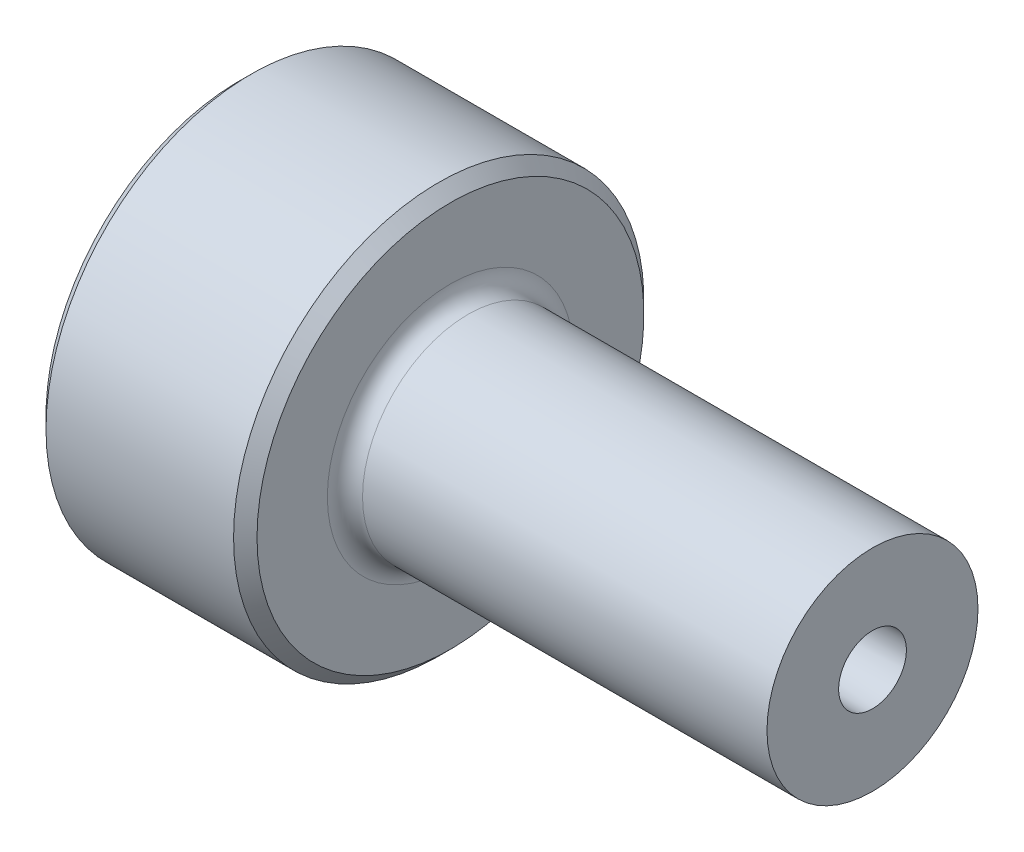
ISO-10303-21;
HEADER;
FILE_DESCRIPTION(('STEP AP214'),'2;1');
FILE_NAME('part.step','',(''),(''),'','','');
FILE_SCHEMA(('AUTOMOTIVE_DESIGN { 1 0 10303 214 1 1 1 1 }'));
ENDSEC;
DATA;
#1=APPLICATION_CONTEXT('core data for automotive mechanical design processes');
#2=APPLICATION_PROTOCOL_DEFINITION('international standard','automotive_design',2000,#1);
#3=PRODUCT_CONTEXT('',#1,'mechanical');
#4=PRODUCT('Part','Part','',(#3));
#5=PRODUCT_RELATED_PRODUCT_CATEGORY('part','',(#4));
#6=PRODUCT_DEFINITION_FORMATION('','',#4);
#7=PRODUCT_DEFINITION_CONTEXT('part definition',#1,'design');
#8=PRODUCT_DEFINITION('design','',#6,#7);
#9=PRODUCT_DEFINITION_SHAPE('','',#8);
#10=(LENGTH_UNIT() NAMED_UNIT(*) SI_UNIT(.MILLI.,.METRE.));
#11=(NAMED_UNIT(*) PLANE_ANGLE_UNIT() SI_UNIT($,.RADIAN.));
#12=(NAMED_UNIT(*) SI_UNIT($,.STERADIAN.) SOLID_ANGLE_UNIT());
#13=UNCERTAINTY_MEASURE_WITH_UNIT(LENGTH_MEASURE(1.E-05),#10,'distance_accuracy_value','');
#14=(GEOMETRIC_REPRESENTATION_CONTEXT(3) GLOBAL_UNCERTAINTY_ASSIGNED_CONTEXT((#13)) GLOBAL_UNIT_ASSIGNED_CONTEXT((#10,
#11,#12)) REPRESENTATION_CONTEXT('',''));
#15=CARTESIAN_POINT('',(0.,0.,0.));
#16=DIRECTION('',(0.,0.,1.));
#17=DIRECTION('',(1.,0.,0.));
#18=AXIS2_PLACEMENT_3D('',#15,#16,#17);
#19=CARTESIAN_POINT('',(0.,4.10062261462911,0.));
#20=DIRECTION('',(1.,0.,0.));
#21=DIRECTION('',(0.,0.,-1.));
#22=AXIS2_PLACEMENT_3D('',#19,#20,#21);
#23=PLANE('',#22);
#24=CARTESIAN_POINT('',(0.,0.,0.));
#25=DIRECTION('',(1.,0.,0.));
#26=DIRECTION('',(0.,0.,-1.));
#27=AXIS2_PLACEMENT_3D('',#24,#25,#26);
#28=CIRCLE('',#27,16.5);
#29=CARTESIAN_POINT('',(0.,0.,-16.5));
#30=VERTEX_POINT('',#29);
#31=EDGE_CURVE('E9',#30,#30,#28,.F.);
#32=ORIENTED_EDGE('',*,*,#31,.T.);
#33=EDGE_LOOP('',(#32));
#34=FACE_BOUND('',#33,.T.);
#35=CARTESIAN_POINT('',(0.,0.,0.));
#36=DIRECTION('',(-1.,0.,0.));
#37=DIRECTION('',(0.,0.,1.));
#38=AXIS2_PLACEMENT_3D('',#35,#36,#37);
#39=CIRCLE('',#38,4.10062261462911);
#40=CARTESIAN_POINT('',(0.,0.,4.10062261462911));
#41=VERTEX_POINT('',#40);
#42=EDGE_CURVE('E49',#41,#41,#39,.T.);
#43=ORIENTED_EDGE('',*,*,#42,.F.);
#44=EDGE_LOOP('',(#43));
#45=FACE_BOUND('',#44,.T.);
#46=ADVANCED_FACE('F14',(#34,#45),#23,.F.);
#47=CARTESIAN_POINT('',(0.,0.,0.));
#48=DIRECTION('',(-1.,0.,0.));
#49=DIRECTION('',(0.,0.,1.));
#50=AXIS2_PLACEMENT_3D('',#47,#48,#49);
#51=CYLINDRICAL_SURFACE('',#50,17.5);
#52=CARTESIAN_POINT('',(17.,0.,0.));
#53=DIRECTION('',(-1.,0.,0.));
#54=DIRECTION('',(0.,0.,1.));
#55=AXIS2_PLACEMENT_3D('',#52,#53,#54);
#56=CIRCLE('',#55,17.5);
#57=CARTESIAN_POINT('',(17.,0.,17.5));
#58=VERTEX_POINT('',#57);
#59=EDGE_CURVE('E25',#58,#58,#56,.T.);
#60=ORIENTED_EDGE('',*,*,#59,.T.);
#61=EDGE_LOOP('',(#60));
#62=FACE_BOUND('',#61,.T.);
#63=CARTESIAN_POINT('',(1.,0.,0.));
#64=DIRECTION('',(1.,0.,0.));
#65=DIRECTION('',(0.,0.,-1.));
#66=AXIS2_PLACEMENT_3D('',#63,#64,#65);
#67=CIRCLE('',#66,17.5);
#68=CARTESIAN_POINT('',(1.,0.,-17.5));
#69=VERTEX_POINT('',#68);
#70=EDGE_CURVE('E29',#69,#69,#67,.T.);
#71=ORIENTED_EDGE('',*,*,#70,.T.);
#72=EDGE_LOOP('',(#71));
#73=FACE_BOUND('',#72,.T.);
#74=ADVANCED_FACE('F56',(#62,#73),#51,.T.);
#75=CARTESIAN_POINT('',(18.,17.5,0.));
#76=DIRECTION('',(-1.,0.,0.));
#77=DIRECTION('',(0.,0.,1.));
#78=AXIS2_PLACEMENT_3D('',#75,#76,#77);
#79=PLANE('',#78);
#80=CARTESIAN_POINT('',(18.,0.,0.));
#81=DIRECTION('',(-1.,0.,0.));
#82=DIRECTION('',(0.,0.,1.));
#83=AXIS2_PLACEMENT_3D('',#80,#81,#82);
#84=CIRCLE('',#83,16.5);
#85=CARTESIAN_POINT('',(18.,0.,16.5));
#86=VERTEX_POINT('',#85);
#87=EDGE_CURVE('E21',#86,#86,#84,.F.);
#88=ORIENTED_EDGE('',*,*,#87,.T.);
#89=EDGE_LOOP('',(#88));
#90=FACE_BOUND('',#89,.T.);
#91=CARTESIAN_POINT('',(18.,0.,0.));
#92=DIRECTION('',(-1.,0.,0.));
#93=DIRECTION('',(0.,0.,1.));
#94=AXIS2_PLACEMENT_3D('',#91,#92,#93);
#95=CIRCLE('',#94,10.5);
#96=CARTESIAN_POINT('',(18.,0.,10.5));
#97=VERTEX_POINT('',#96);
#98=EDGE_CURVE('E34',#97,#97,#95,.T.);
#99=ORIENTED_EDGE('',*,*,#98,.T.);
#100=EDGE_LOOP('',(#99));
#101=FACE_BOUND('',#100,.T.);
#102=ADVANCED_FACE('F63',(#90,#101),#79,.F.);
#103=CARTESIAN_POINT('',(19.5,0.,0.));
#104=DIRECTION('',(-1.,0.,0.));
#105=DIRECTION('',(0.,0.,1.));
#106=AXIS2_PLACEMENT_3D('',#103,#104,#105);
#107=TOROIDAL_SURFACE('',#106,10.5,1.5);
#108=ORIENTED_EDGE('',*,*,#98,.F.);
#109=EDGE_LOOP('',(#108));
#110=FACE_BOUND('',#109,.T.);
#111=CARTESIAN_POINT('',(19.5,0.,0.));
#112=DIRECTION('',(-1.,0.,0.));
#113=DIRECTION('',(0.,0.,1.));
#114=AXIS2_PLACEMENT_3D('',#111,#112,#113);
#115=CIRCLE('',#114,9.);
#116=CARTESIAN_POINT('',(19.5,0.,9.));
#117=VERTEX_POINT('',#116);
#118=EDGE_CURVE('E37',#117,#117,#115,.T.);
#119=ORIENTED_EDGE('',*,*,#118,.T.);
#120=EDGE_LOOP('',(#119));
#121=FACE_BOUND('',#120,.T.);
#122=ADVANCED_FACE('F99',(#110,#121),#107,.F.);
#123=CARTESIAN_POINT('',(0.,0.,0.));
#124=DIRECTION('',(-1.,0.,0.));
#125=DIRECTION('',(0.,0.,1.));
#126=AXIS2_PLACEMENT_3D('',#123,#124,#125);
#127=CYLINDRICAL_SURFACE('',#126,9.);
#128=ORIENTED_EDGE('',*,*,#118,.F.);
#129=EDGE_LOOP('',(#128));
#130=FACE_BOUND('',#129,.T.);
#131=CARTESIAN_POINT('',(54.,0.,0.));
#132=DIRECTION('',(-1.,0.,0.));
#133=DIRECTION('',(0.,0.,1.));
#134=AXIS2_PLACEMENT_3D('',#131,#132,#133);
#135=CIRCLE('',#134,9.);
#136=CARTESIAN_POINT('',(54.,0.,9.));
#137=VERTEX_POINT('',#136);
#138=EDGE_CURVE('E40',#137,#137,#135,.T.);
#139=ORIENTED_EDGE('',*,*,#138,.T.);
#140=EDGE_LOOP('',(#139));
#141=FACE_BOUND('',#140,.T.);
#142=ADVANCED_FACE('F95',(#130,#141),#127,.T.);
#143=CARTESIAN_POINT('',(54.,2.8902083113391,0.));
#144=DIRECTION('',(-1.,0.,0.));
#145=DIRECTION('',(0.,0.,1.));
#146=AXIS2_PLACEMENT_3D('',#143,#144,#145);
#147=PLANE('',#146);
#148=ORIENTED_EDGE('',*,*,#138,.F.);
#149=EDGE_LOOP('',(#148));
#150=FACE_BOUND('',#149,.T.);
#151=CARTESIAN_POINT('',(54.,0.,0.));
#152=DIRECTION('',(-1.,0.,0.));
#153=DIRECTION('',(0.,0.,1.));
#154=AXIS2_PLACEMENT_3D('',#151,#152,#153);
#155=CIRCLE('',#154,2.8902083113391);
#156=CARTESIAN_POINT('',(54.,0.,2.8902083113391));
#157=VERTEX_POINT('',#156);
#158=EDGE_CURVE('E43',#157,#157,#155,.T.);
#159=ORIENTED_EDGE('',*,*,#158,.T.);
#160=EDGE_LOOP('',(#159));
#161=FACE_BOUND('',#160,.T.);
#162=ADVANCED_FACE('F88',(#150,#161),#147,.F.);
#163=CARTESIAN_POINT('',(3.,0.,0.));
#164=DIRECTION('',(1.,0.,0.));
#165=DIRECTION('',(0.,0.,-1.));
#166=AXIS2_PLACEMENT_3D('',#163,#164,#165);
#167=CONICAL_SURFACE('',#166,2.,0.0174532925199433);
#168=ORIENTED_EDGE('',*,*,#158,.F.);
#169=EDGE_LOOP('',(#168));
#170=FACE_BOUND('',#169,.T.);
#171=CARTESIAN_POINT('',(3.,0.,0.));
#172=DIRECTION('',(-1.,0.,0.));
#173=DIRECTION('',(0.,0.,1.));
#174=AXIS2_PLACEMENT_3D('',#171,#172,#173);
#175=CIRCLE('',#174,2.);
#176=CARTESIAN_POINT('',(3.,0.,2.));
#177=VERTEX_POINT('',#176);
#178=EDGE_CURVE('E46',#177,#177,#175,.T.);
#179=ORIENTED_EDGE('',*,*,#178,.T.);
#180=EDGE_LOOP('',(#179));
#181=FACE_BOUND('',#180,.T.);
#182=ADVANCED_FACE('F76',(#170,#181),#167,.F.);
#183=CARTESIAN_POINT('',(0.,0.,0.));
#184=DIRECTION('',(-1.,0.,0.));
#185=DIRECTION('',(0.,0.,1.));
#186=AXIS2_PLACEMENT_3D('',#183,#184,#185);
#187=CONICAL_SURFACE('',#186,4.10062261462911,0.61086523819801);
#188=ORIENTED_EDGE('',*,*,#178,.F.);
#189=EDGE_LOOP('',(#188));
#190=FACE_BOUND('',#189,.T.);
#191=ORIENTED_EDGE('',*,*,#42,.T.);
#192=EDGE_LOOP('',(#191));
#193=FACE_BOUND('',#192,.T.);
#194=ADVANCED_FACE('F53',(#190,#193),#187,.F.);
#195=CARTESIAN_POINT('',(17.,0.,0.));
#196=DIRECTION('',(-1.,0.,0.));
#197=DIRECTION('',(0.,0.,1.));
#198=AXIS2_PLACEMENT_3D('',#195,#196,#197);
#199=CONICAL_SURFACE('',#198,17.5,0.785398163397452);
#200=ORIENTED_EDGE('',*,*,#87,.F.);
#201=EDGE_LOOP('',(#200));
#202=FACE_BOUND('',#201,.T.);
#203=ORIENTED_EDGE('',*,*,#59,.F.);
#204=EDGE_LOOP('',(#203));
#205=FACE_BOUND('',#204,.T.);
#206=ADVANCED_FACE('F67',(#202,#205),#199,.T.);
#207=CARTESIAN_POINT('',(0.,0.,0.));
#208=DIRECTION('',(1.,0.,0.));
#209=DIRECTION('',(0.,0.,-1.));
#210=AXIS2_PLACEMENT_3D('',#207,#208,#209);
#211=CONICAL_SURFACE('',#210,16.5,0.785398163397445);
#212=ORIENTED_EDGE('',*,*,#70,.F.);
#213=EDGE_LOOP('',(#212));
#214=FACE_BOUND('',#213,.T.);
#215=ORIENTED_EDGE('',*,*,#31,.F.);
#216=EDGE_LOOP('',(#215));
#217=FACE_BOUND('',#216,.T.);
#218=ADVANCED_FACE('F16',(#214,#217),#211,.T.);
#219=CLOSED_SHELL('',(#46,#74,#102,#122,#142,#162,#182,#194,#206,#218));
#220=MANIFOLD_SOLID_BREP('B1',#219);
#221=ADVANCED_BREP_SHAPE_REPRESENTATION('',(#18,#220),#14);
#222=SHAPE_DEFINITION_REPRESENTATION(#9,#221);
ENDSEC;
END-ISO-10303-21;
